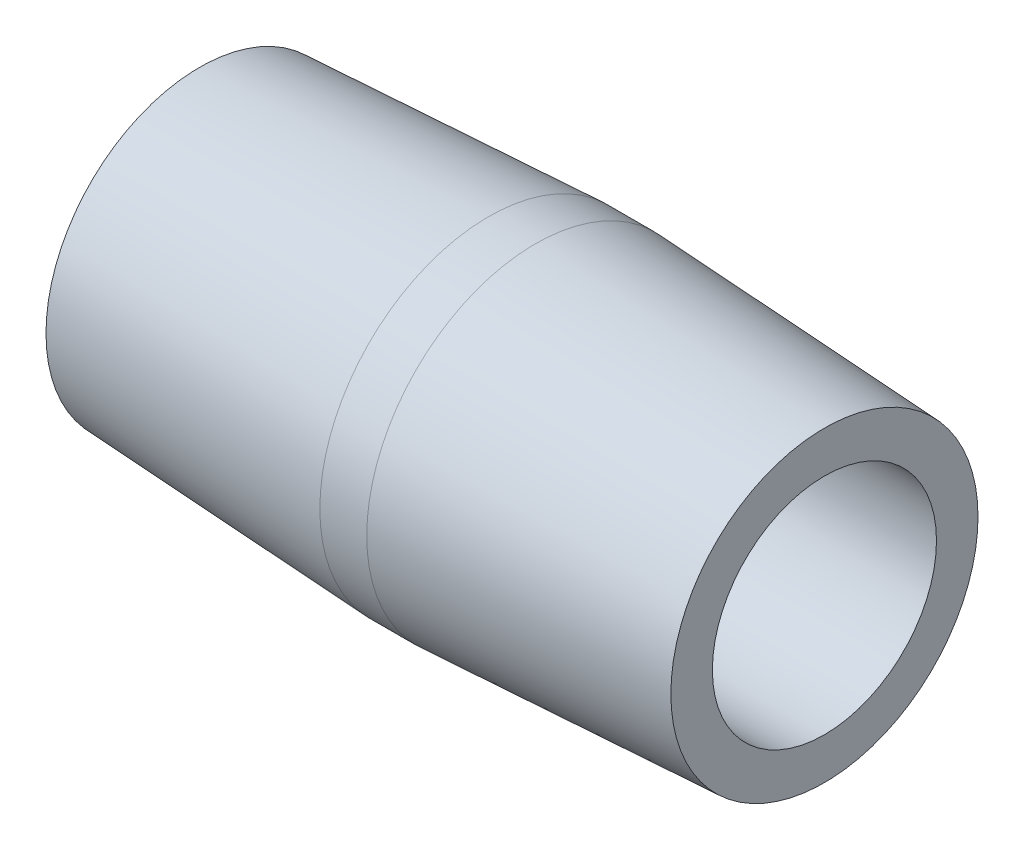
from build123d import *


with BuildPart() as part:
    # Sketch2 → Revolve1 (revolve)
    with BuildSketch(Plane.XY, mode=Mode.PRIVATE) as revolve1_sk:
        Polygon((8.810039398, 5.1435), (0, 4.6817854), (0, 3.4163), (19.05, 3.4163), (19.05, 4.6817854), (10.239960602, 5.1435), align=None)
    revolve(revolve1_sk.sketch.rotate(Axis((0.476141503, 0, 0), (1, 0, 0)), 90), axis=Axis((0.476141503, 0, 0), (1, 0, 0)))


solid = part.part
